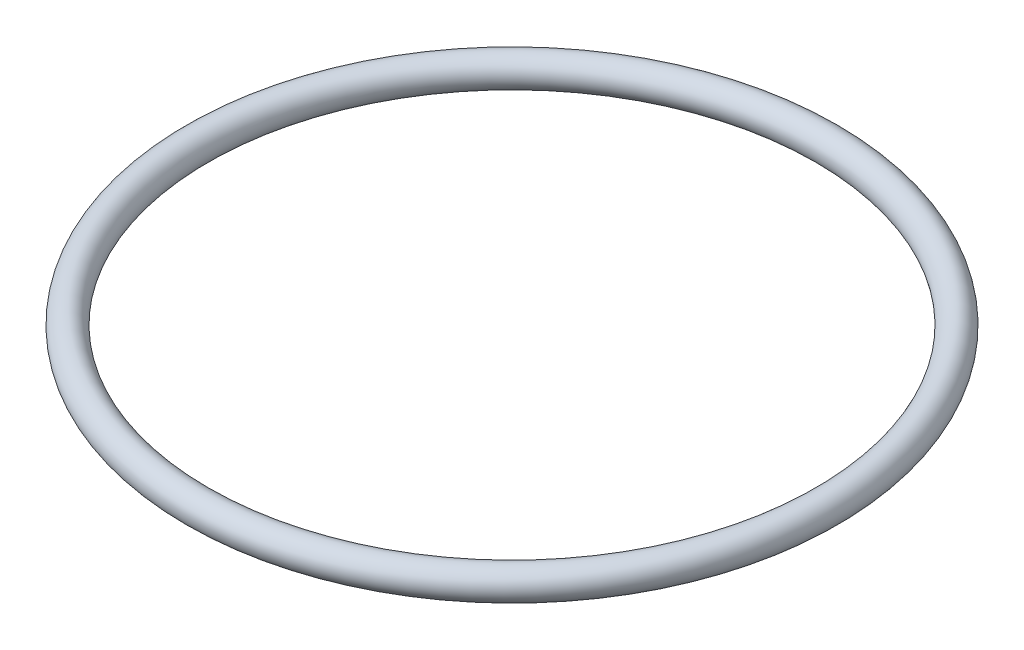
ISO-10303-21;
HEADER;
FILE_DESCRIPTION(('STEP AP214'),'2;1');
FILE_NAME('part.step','',(''),(''),'','','');
FILE_SCHEMA(('AUTOMOTIVE_DESIGN { 1 0 10303 214 1 1 1 1 }'));
ENDSEC;
DATA;
#1=APPLICATION_CONTEXT('core data for automotive mechanical design processes');
#2=APPLICATION_PROTOCOL_DEFINITION('international standard','automotive_design',2000,#1);
#3=PRODUCT_CONTEXT('',#1,'mechanical');
#4=PRODUCT('Part','Part','',(#3));
#5=PRODUCT_RELATED_PRODUCT_CATEGORY('part','',(#4));
#6=PRODUCT_DEFINITION_FORMATION('','',#4);
#7=PRODUCT_DEFINITION_CONTEXT('part definition',#1,'design');
#8=PRODUCT_DEFINITION('design','',#6,#7);
#9=PRODUCT_DEFINITION_SHAPE('','',#8);
#10=(LENGTH_UNIT() NAMED_UNIT(*) SI_UNIT(.MILLI.,.METRE.));
#11=(NAMED_UNIT(*) PLANE_ANGLE_UNIT() SI_UNIT($,.RADIAN.));
#12=(NAMED_UNIT(*) SI_UNIT($,.STERADIAN.) SOLID_ANGLE_UNIT());
#13=UNCERTAINTY_MEASURE_WITH_UNIT(LENGTH_MEASURE(1.E-05),#10,'distance_accuracy_value','');
#14=(GEOMETRIC_REPRESENTATION_CONTEXT(3) GLOBAL_UNCERTAINTY_ASSIGNED_CONTEXT((#13)) GLOBAL_UNIT_ASSIGNED_CONTEXT((#10,
#11,#12)) REPRESENTATION_CONTEXT('',''));
#15=CARTESIAN_POINT('',(0.,0.,0.));
#16=DIRECTION('',(0.,0.,1.));
#17=DIRECTION('',(1.,0.,0.));
#18=AXIS2_PLACEMENT_3D('',#15,#16,#17);
#19=CARTESIAN_POINT('',(0.,3.,0.));
#20=DIRECTION('',(0.,1.,0.));
#21=DIRECTION('',(0.,0.,1.));
#22=AXIS2_PLACEMENT_3D('',#19,#20,#21);
#23=TOROIDAL_SURFACE('',#22,62.,3.);
#24=CARTESIAN_POINT('',(0.,3.,65.));
#25=VERTEX_POINT('',#24);
#26=VERTEX_LOOP('',#25);
#27=FACE_BOUND('',#26,.T.);
#28=ADVANCED_FACE('F30',(#27),#23,.T.);
#29=CLOSED_SHELL('',(#28));
#30=MANIFOLD_SOLID_BREP('B2',#29);
#31=ADVANCED_BREP_SHAPE_REPRESENTATION('',(#18,#30),#14);
#32=SHAPE_DEFINITION_REPRESENTATION(#9,#31);
ENDSEC;
END-ISO-10303-21;
